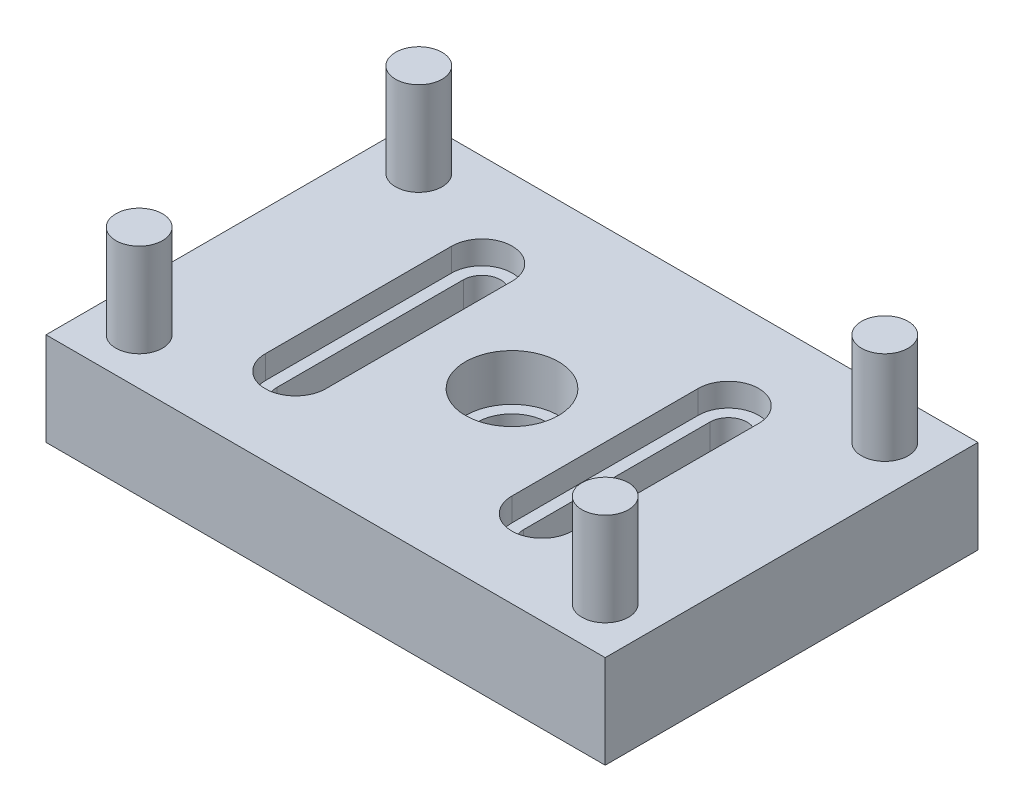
from build123d import *

# Parameters (mm, degrees)
SKETCH1_W           = 152.4
SKETCH1_H           = 101.6
BOSS_EXTRUDE1_DEPTH = 25.4
CUT_EXTRUDE1_DEPTH  = 96.038097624
CUT_EXTRUDE2_DEPTH  = 6.35
SKETCH1_5_R         = 6.35
BOSS_EXTRUDE2_DEPTH = 25.4
SKETCH1_6_R         = 9.525
CUT_EXTRUDE3_DEPTH  = 96.038097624
SKETCH1_7_R         = 12.7
SKETCH1_7_R_2       = 9.525
CUT_EXTRUDE4_DEPTH  = 12.7


with BuildPart() as part:
    # Sketch1 → Boss-Extrude1 (new body)
    with BuildSketch(Plane(origin=(0, 0, 0), x_dir=(1, 0, 0), z_dir=(0, 1, 0))):
        Rectangle(SKETCH1_W, SKETCH1_H)
    extrude(amount=-BOSS_EXTRUDE1_DEPTH)

    # Sketch1_3 → Cut-Extrude1 (cut, through all)
    with BuildSketch(Plane(origin=(0, 0, 0), x_dir=(1, 0, 0), z_dir=(0, 1, 0))):
        with BuildLine():
            Line((-28.5115, -25.4), (-28.5115, 25.4))
            ThreePointArc((-28.5115, 25.4), (-33.5915, 30.48), (-38.6715, 25.4))
            Line((-38.6715, 25.4), (-38.6715, -25.4))
            ThreePointArc((-38.6715, -25.4), (-33.5915, -30.48), (-28.5115, -25.4))
        make_face()
        with BuildLine():
            ThreePointArc((28.5115, 25.4), (33.5915, 30.48), (38.6715, 25.4))
            Line((38.6715, 25.4), (38.6715, -25.4))
            ThreePointArc((38.6715, -25.4), (33.5915, -30.48), (28.5115, -25.4))
            Line((28.5115, -25.4), (28.5115, 25.4))
        make_face()
    extrude(amount=-CUT_EXTRUDE1_DEPTH, mode=Mode.SUBTRACT)

    # Sketch1_4 → Cut-Extrude2 (cut)
    # profile 1 of 2: a face of its own
    with BuildSketch(Plane(origin=(0, 0, 0), x_dir=(1, 0, 0), z_dir=(0, 1, 0))):
        with BuildLine():
            Line((-41.8465, 25.4), (-41.8465, -25.4))
            ThreePointArc((-41.8465, -25.4), (-33.5915, -33.655), (-25.3365, -25.4))
            Line((-25.3365, -25.4), (-25.3365, 25.4))
            ThreePointArc((-25.3365, 25.4), (-33.5915, 33.655), (-41.8465, 25.4))
        make_face()
        with BuildLine():
            ThreePointArc((-28.5115, 25.4), (-33.5915, 30.48), (-38.6715, 25.4))
            Line((-38.6715, 25.4), (-38.6715, -25.4))
            ThreePointArc((-38.6715, -25.4), (-33.5915, -30.48), (-28.5115, -25.4))
            Line((-28.5115, -25.4), (-28.5115, 25.4))
        make_face(mode=Mode.SUBTRACT)
    # profile 2 of 2: a face of its own
    with BuildSketch(Plane(origin=(0, 0, 0), x_dir=(1, 0, 0), z_dir=(0, 1, 0))):
        with BuildLine():
            ThreePointArc((41.8465, -25.4), (33.5915, -33.655), (25.3365, -25.4))
            Line((25.3365, -25.4), (25.3365, 25.4))
            ThreePointArc((25.3365, 25.4), (33.5915, 33.655), (41.8465, 25.4))
            Line((41.8465, 25.4), (41.8465, -25.4))
        make_face()
        with BuildLine():
            Line((28.5115, -25.4), (28.5115, 25.4))
            ThreePointArc((28.5115, 25.4), (33.5915, 30.48), (38.6715, 25.4))
            Line((38.6715, 25.4), (38.6715, -25.4))
            ThreePointArc((38.6715, -25.4), (33.5915, -30.48), (28.5115, -25.4))
        make_face(mode=Mode.SUBTRACT)
    extrude(amount=-CUT_EXTRUDE2_DEPTH, mode=Mode.SUBTRACT)

    # Sketch1_5 → Boss-Extrude2 (add)
    with BuildSketch(Plane(origin=(0, 0, 0), x_dir=(1, 0, 0), z_dir=(0, 1, 0))):
        with Locations(Location((63.5, 38.1, 0), (0, 0, 90))):
            Circle(SKETCH1_5_R)
        with Locations(Location((-63.5, 38.1, 0), (0, 0, 90))):
            Circle(SKETCH1_5_R)
        with Locations(Location((-63.5, -38.1, 0), (0, 0, 90))):
            Circle(SKETCH1_5_R)
        with Locations(Location((63.5, -38.1, 0), (0, 0, 90))):
            Circle(SKETCH1_5_R)
    extrude(amount=BOSS_EXTRUDE2_DEPTH)

    # Sketch1_6 → Cut-Extrude3 (cut, through all)
    with BuildSketch(Plane(origin=(0, 0, 0), x_dir=(1, 0, 0), z_dir=(0, 1, 0))):
        with Locations(Location((0, 0, 0), (0, 0, 270))):
            Circle(SKETCH1_6_R)
    extrude(amount=-CUT_EXTRUDE3_DEPTH, mode=Mode.SUBTRACT)

    # Sketch1_7 → Cut-Extrude4 (cut)
    with BuildSketch(Plane(origin=(0, 0, 0), x_dir=(1, 0, 0), z_dir=(0, 1, 0))):
        with Locations(Location((0, 0, 0), (0, 0, 270))):
            Circle(SKETCH1_7_R)
        with Locations(Location((0, 0, 0), (0, 0, 270))):
            Circle(SKETCH1_7_R_2, mode=Mode.SUBTRACT)
    extrude(amount=-CUT_EXTRUDE4_DEPTH, mode=Mode.SUBTRACT)


solid = part.part
